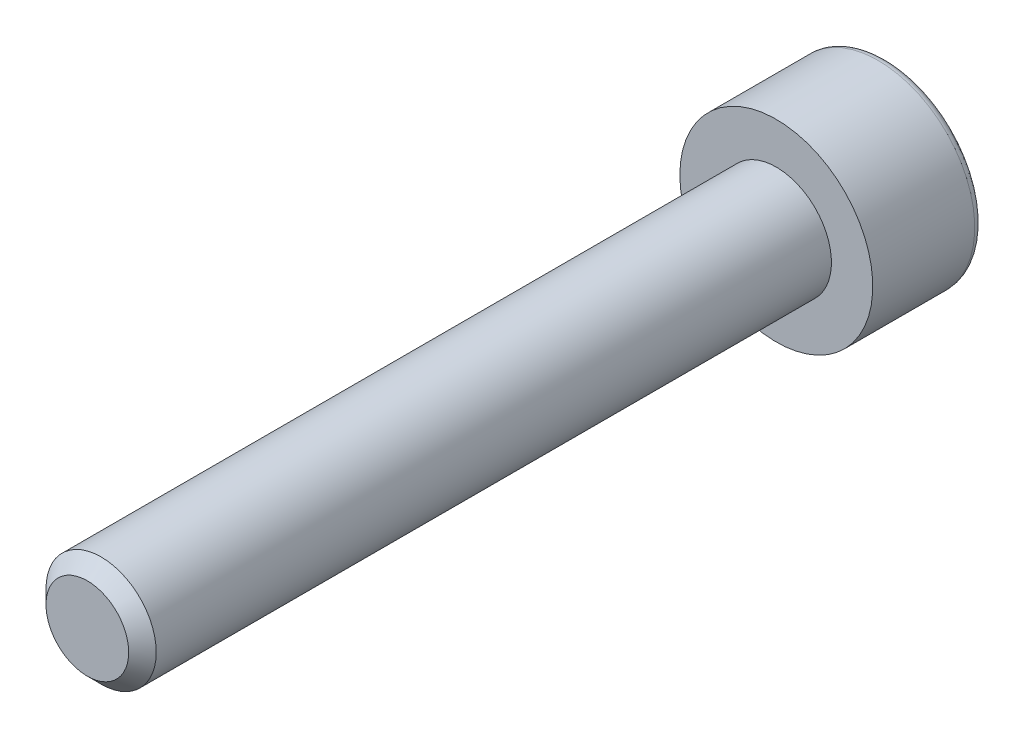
ISO-10303-21;
HEADER;
FILE_DESCRIPTION(('STEP AP214'),'2;1');
FILE_NAME('part.step','',(''),(''),'','','');
FILE_SCHEMA(('AUTOMOTIVE_DESIGN { 1 0 10303 214 1 1 1 1 }'));
ENDSEC;
DATA;
#1=APPLICATION_CONTEXT('core data for automotive mechanical design processes');
#2=APPLICATION_PROTOCOL_DEFINITION('international standard','automotive_design',2000,#1);
#3=PRODUCT_CONTEXT('',#1,'mechanical');
#4=PRODUCT('Part','Part','',(#3));
#5=PRODUCT_RELATED_PRODUCT_CATEGORY('part','',(#4));
#6=PRODUCT_DEFINITION_FORMATION('','',#4);
#7=PRODUCT_DEFINITION_CONTEXT('part definition',#1,'design');
#8=PRODUCT_DEFINITION('design','',#6,#7);
#9=PRODUCT_DEFINITION_SHAPE('','',#8);
#10=(LENGTH_UNIT() NAMED_UNIT(*) SI_UNIT(.MILLI.,.METRE.));
#11=(NAMED_UNIT(*) PLANE_ANGLE_UNIT() SI_UNIT($,.RADIAN.));
#12=(NAMED_UNIT(*) SI_UNIT($,.STERADIAN.) SOLID_ANGLE_UNIT());
#13=UNCERTAINTY_MEASURE_WITH_UNIT(LENGTH_MEASURE(1.E-05),#10,'distance_accuracy_value','');
#14=(GEOMETRIC_REPRESENTATION_CONTEXT(3) GLOBAL_UNCERTAINTY_ASSIGNED_CONTEXT((#13)) GLOBAL_UNIT_ASSIGNED_CONTEXT((#10,
#11,#12)) REPRESENTATION_CONTEXT('',''));
#15=CARTESIAN_POINT('',(0.,0.,0.));
#16=DIRECTION('',(0.,0.,1.));
#17=DIRECTION('',(1.,0.,0.));
#18=AXIS2_PLACEMENT_3D('',#15,#16,#17);
#19=CARTESIAN_POINT('',(0.,0.,25.));
#20=DIRECTION('',(0.,0.,-1.));
#21=DIRECTION('',(-1.,0.,0.));
#22=AXIS2_PLACEMENT_3D('',#19,#20,#21);
#23=CYLINDRICAL_SURFACE('',#22,2.);
#24=CARTESIAN_POINT('',(0.,0.,24.5));
#25=DIRECTION('',(0.,0.,1.));
#26=DIRECTION('',(1.,0.,0.));
#27=AXIS2_PLACEMENT_3D('',#24,#25,#26);
#28=CIRCLE('',#27,2.);
#29=CARTESIAN_POINT('',(2.,0.,24.5));
#30=VERTEX_POINT('',#29);
#31=EDGE_CURVE('E150',#30,#30,#28,.F.);
#32=ORIENTED_EDGE('',*,*,#31,.T.);
#33=EDGE_LOOP('',(#32));
#34=FACE_BOUND('',#33,.T.);
#35=CARTESIAN_POINT('',(0.,0.,0.));
#36=DIRECTION('',(0.,0.,-1.));
#37=DIRECTION('',(-1.,0.,0.));
#38=AXIS2_PLACEMENT_3D('',#35,#36,#37);
#39=CIRCLE('',#38,2.);
#40=CARTESIAN_POINT('',(-2.,0.,0.));
#41=VERTEX_POINT('',#40);
#42=EDGE_CURVE('E144',#41,#41,#39,.T.);
#43=ORIENTED_EDGE('',*,*,#42,.F.);
#44=EDGE_LOOP('',(#43));
#45=FACE_BOUND('',#44,.T.);
#46=ADVANCED_FACE('F34',(#34,#45),#23,.T.);
#47=CARTESIAN_POINT('',(0.,0.,25.));
#48=DIRECTION('',(0.,0.,1.));
#49=DIRECTION('',(1.,0.,0.));
#50=AXIS2_PLACEMENT_3D('',#47,#48,#49);
#51=PLANE('',#50);
#52=CARTESIAN_POINT('',(0.,0.,25.));
#53=DIRECTION('',(0.,0.,1.));
#54=DIRECTION('',(1.,0.,0.));
#55=AXIS2_PLACEMENT_3D('',#52,#53,#54);
#56=CIRCLE('',#55,1.5);
#57=CARTESIAN_POINT('',(1.5,0.,25.));
#58=VERTEX_POINT('',#57);
#59=EDGE_CURVE('E147',#58,#58,#56,.T.);
#60=ORIENTED_EDGE('',*,*,#59,.T.);
#61=EDGE_LOOP('',(#60));
#62=FACE_BOUND('',#61,.T.);
#63=ADVANCED_FACE('F171',(#62),#51,.T.);
#64=CARTESIAN_POINT('',(0.,0.,25.));
#65=DIRECTION('',(0.,0.,-1.));
#66=DIRECTION('',(-1.,0.,0.));
#67=AXIS2_PLACEMENT_3D('',#64,#65,#66);
#68=CONICAL_SURFACE('',#67,1.5,0.785398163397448);
#69=ORIENTED_EDGE('',*,*,#31,.F.);
#70=EDGE_LOOP('',(#69));
#71=FACE_BOUND('',#70,.T.);
#72=ORIENTED_EDGE('',*,*,#59,.F.);
#73=EDGE_LOOP('',(#72));
#74=FACE_BOUND('',#73,.T.);
#75=ADVANCED_FACE('F177',(#71,#74),#68,.T.);
#76=CARTESIAN_POINT('',(0.,0.,0.));
#77=DIRECTION('',(0.,0.,-1.));
#78=DIRECTION('',(-1.,0.,0.));
#79=AXIS2_PLACEMENT_3D('',#76,#77,#78);
#80=PLANE('',#79);
#81=CARTESIAN_POINT('',(0.,0.,0.));
#82=DIRECTION('',(0.,0.,-1.));
#83=DIRECTION('',(-1.,0.,0.));
#84=AXIS2_PLACEMENT_3D('',#81,#82,#83);
#85=CIRCLE('',#84,3.5);
#86=CARTESIAN_POINT('',(-3.5,0.,0.));
#87=VERTEX_POINT('',#86);
#88=EDGE_CURVE('E136',#87,#87,#85,.T.);
#89=ORIENTED_EDGE('',*,*,#88,.F.);
#90=EDGE_LOOP('',(#89));
#91=FACE_BOUND('',#90,.T.);
#92=ORIENTED_EDGE('',*,*,#42,.T.);
#93=EDGE_LOOP('',(#92));
#94=FACE_BOUND('',#93,.T.);
#95=ADVANCED_FACE('F183',(#91,#94),#80,.F.);
#96=CARTESIAN_POINT('',(0.,0.,-4.));
#97=DIRECTION('',(0.,0.,1.));
#98=DIRECTION('',(1.,0.,0.));
#99=AXIS2_PLACEMENT_3D('',#96,#97,#98);
#100=CYLINDRICAL_SURFACE('',#99,3.5);
#101=CARTESIAN_POINT('',(0.,0.,-3.7));
#102=DIRECTION('',(0.,0.,-1.));
#103=DIRECTION('',(-1.,0.,0.));
#104=AXIS2_PLACEMENT_3D('',#101,#102,#103);
#105=CIRCLE('',#104,3.5);
#106=CARTESIAN_POINT('',(-3.5,0.,-3.7));
#107=VERTEX_POINT('',#106);
#108=EDGE_CURVE('E11',#107,#107,#105,.F.);
#109=ORIENTED_EDGE('',*,*,#108,.T.);
#110=EDGE_LOOP('',(#109));
#111=FACE_BOUND('',#110,.T.);
#112=ORIENTED_EDGE('',*,*,#88,.T.);
#113=EDGE_LOOP('',(#112));
#114=FACE_BOUND('',#113,.T.);
#115=ADVANCED_FACE('F166',(#111,#114),#100,.T.);
#116=CARTESIAN_POINT('',(0.,0.,-4.));
#117=DIRECTION('',(0.,0.,-1.));
#118=DIRECTION('',(-1.,0.,0.));
#119=AXIS2_PLACEMENT_3D('',#116,#117,#118);
#120=PLANE('',#119);
#121=DIRECTION('',(0.866025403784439,0.5,0.));
#122=VECTOR('',#121,1.);
#123=CARTESIAN_POINT('',(-1.5,0.86602540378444,-4.));
#124=LINE('',#123,#122);
#125=CARTESIAN_POINT('',(-1.5,0.86602540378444,-4.));
#126=VERTEX_POINT('',#125);
#127=CARTESIAN_POINT('',(0.,1.73205080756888,-4.));
#128=VERTEX_POINT('',#127);
#129=EDGE_CURVE('E49',#126,#128,#124,.T.);
#130=ORIENTED_EDGE('',*,*,#129,.F.);
#131=DIRECTION('',(0.,1.,0.));
#132=VECTOR('',#131,1.);
#133=CARTESIAN_POINT('',(-1.5,-0.86602540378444,-4.));
#134=LINE('',#133,#132);
#135=CARTESIAN_POINT('',(-1.5,-0.86602540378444,-4.));
#136=VERTEX_POINT('',#135);
#137=EDGE_CURVE('E132',#136,#126,#134,.T.);
#138=ORIENTED_EDGE('',*,*,#137,.F.);
#139=DIRECTION('',(-0.866025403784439,0.5,0.));
#140=VECTOR('',#139,1.);
#141=CARTESIAN_POINT('',(0.,-1.73205080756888,-4.));
#142=LINE('',#141,#140);
#143=CARTESIAN_POINT('',(0.,-1.73205080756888,-4.));
#144=VERTEX_POINT('',#143);
#145=EDGE_CURVE('E130',#144,#136,#142,.T.);
#146=ORIENTED_EDGE('',*,*,#145,.F.);
#147=DIRECTION('',(-0.866025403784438,-0.5,0.));
#148=VECTOR('',#147,1.);
#149=CARTESIAN_POINT('',(1.5,-0.866025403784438,-4.));
#150=LINE('',#149,#148);
#151=CARTESIAN_POINT('',(1.5,-0.866025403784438,-4.));
#152=VERTEX_POINT('',#151);
#153=EDGE_CURVE('E97',#152,#144,#150,.T.);
#154=ORIENTED_EDGE('',*,*,#153,.F.);
#155=DIRECTION('',(0.,-1.,0.));
#156=VECTOR('',#155,1.);
#157=CARTESIAN_POINT('',(1.5,0.866025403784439,-4.));
#158=LINE('',#157,#156);
#159=CARTESIAN_POINT('',(1.5,0.866025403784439,-4.));
#160=VERTEX_POINT('',#159);
#161=EDGE_CURVE('E126',#160,#152,#158,.T.);
#162=ORIENTED_EDGE('',*,*,#161,.F.);
#163=DIRECTION('',(0.866025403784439,-0.5,0.));
#164=VECTOR('',#163,1.);
#165=CARTESIAN_POINT('',(0.,1.73205080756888,-4.));
#166=LINE('',#165,#164);
#167=EDGE_CURVE('E123',#128,#160,#166,.T.);
#168=ORIENTED_EDGE('',*,*,#167,.F.);
#169=EDGE_LOOP('',(#130,#138,#146,#154,#162,#168));
#170=FACE_BOUND('',#169,.T.);
#171=CARTESIAN_POINT('',(0.,0.,-4.));
#172=DIRECTION('',(0.,0.,-1.));
#173=DIRECTION('',(-1.,0.,0.));
#174=AXIS2_PLACEMENT_3D('',#171,#172,#173);
#175=CIRCLE('',#174,3.2);
#176=CARTESIAN_POINT('',(-3.2,0.,-4.));
#177=VERTEX_POINT('',#176);
#178=EDGE_CURVE('E42',#177,#177,#175,.T.);
#179=ORIENTED_EDGE('',*,*,#178,.T.);
#180=EDGE_LOOP('',(#179));
#181=FACE_BOUND('',#180,.T.);
#182=ADVANCED_FACE('F155',(#170,#181),#120,.T.);
#183=CARTESIAN_POINT('',(0.,0.,-3.7));
#184=DIRECTION('',(0.,0.,-1.));
#185=DIRECTION('',(-1.,0.,0.));
#186=AXIS2_PLACEMENT_3D('',#183,#184,#185);
#187=TOROIDAL_SURFACE('',#186,3.2,0.3);
#188=ORIENTED_EDGE('',*,*,#108,.F.);
#189=EDGE_LOOP('',(#188));
#190=FACE_BOUND('',#189,.T.);
#191=ORIENTED_EDGE('',*,*,#178,.F.);
#192=EDGE_LOOP('',(#191));
#193=FACE_BOUND('',#192,.T.);
#194=ADVANCED_FACE('F36',(#190,#193),#187,.T.);
#195=CARTESIAN_POINT('',(-1.5,0.86602540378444,0.));
#196=DIRECTION('',(-0.5,0.866025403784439,0.));
#197=DIRECTION('',(-0.866025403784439,-0.5,0.));
#198=AXIS2_PLACEMENT_3D('',#195,#196,#197);
#199=PLANE('',#198);
#200=ORIENTED_EDGE('',*,*,#129,.T.);
#201=DIRECTION('',(0.,0.,-1.));
#202=VECTOR('',#201,1.);
#203=CARTESIAN_POINT('',(0.,1.73205080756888,0.));
#204=LINE('',#203,#202);
#205=CARTESIAN_POINT('',(0.,1.73205080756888,0.));
#206=VERTEX_POINT('',#205);
#207=EDGE_CURVE('E79',#206,#128,#204,.T.);
#208=ORIENTED_EDGE('',*,*,#207,.F.);
#209=DIRECTION('',(0.866025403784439,0.5,0.));
#210=VECTOR('',#209,1.);
#211=CARTESIAN_POINT('',(-1.5,0.86602540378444,0.));
#212=LINE('',#211,#210);
#213=CARTESIAN_POINT('',(-1.5,0.86602540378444,0.));
#214=VERTEX_POINT('',#213);
#215=EDGE_CURVE('E134',#214,#206,#212,.T.);
#216=ORIENTED_EDGE('',*,*,#215,.F.);
#217=DIRECTION('',(0.,0.,-1.));
#218=VECTOR('',#217,1.);
#219=CARTESIAN_POINT('',(-1.5,0.86602540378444,0.));
#220=LINE('',#219,#218);
#221=EDGE_CURVE('E57',#214,#126,#220,.T.);
#222=ORIENTED_EDGE('',*,*,#221,.T.);
#223=EDGE_LOOP('',(#200,#208,#216,#222));
#224=FACE_BOUND('',#223,.T.);
#225=ADVANCED_FACE('F158',(#224),#199,.F.);
#226=CARTESIAN_POINT('',(-1.5,-0.86602540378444,0.));
#227=DIRECTION('',(-1.,0.,0.));
#228=DIRECTION('',(0.,-1.,0.));
#229=AXIS2_PLACEMENT_3D('',#226,#227,#228);
#230=PLANE('',#229);
#231=ORIENTED_EDGE('',*,*,#137,.T.);
#232=ORIENTED_EDGE('',*,*,#221,.F.);
#233=DIRECTION('',(0.,1.,0.));
#234=VECTOR('',#233,1.);
#235=CARTESIAN_POINT('',(-1.5,-0.86602540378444,0.));
#236=LINE('',#235,#234);
#237=CARTESIAN_POINT('',(-1.5,-0.86602540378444,0.));
#238=VERTEX_POINT('',#237);
#239=EDGE_CURVE('E109',#238,#214,#236,.T.);
#240=ORIENTED_EDGE('',*,*,#239,.F.);
#241=DIRECTION('',(0.,0.,-1.));
#242=VECTOR('',#241,1.);
#243=CARTESIAN_POINT('',(-1.5,-0.86602540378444,0.));
#244=LINE('',#243,#242);
#245=EDGE_CURVE('E101',#238,#136,#244,.T.);
#246=ORIENTED_EDGE('',*,*,#245,.T.);
#247=EDGE_LOOP('',(#231,#232,#240,#246));
#248=FACE_BOUND('',#247,.T.);
#249=ADVANCED_FACE('F164',(#248),#230,.F.);
#250=CARTESIAN_POINT('',(0.,-1.73205080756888,0.));
#251=DIRECTION('',(-0.5,-0.866025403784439,0.));
#252=DIRECTION('',(0.866025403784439,-0.5,0.));
#253=AXIS2_PLACEMENT_3D('',#250,#251,#252);
#254=PLANE('',#253);
#255=ORIENTED_EDGE('',*,*,#145,.T.);
#256=ORIENTED_EDGE('',*,*,#245,.F.);
#257=DIRECTION('',(-0.866025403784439,0.5,0.));
#258=VECTOR('',#257,1.);
#259=CARTESIAN_POINT('',(0.,-1.73205080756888,0.));
#260=LINE('',#259,#258);
#261=CARTESIAN_POINT('',(0.,-1.73205080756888,0.));
#262=VERTEX_POINT('',#261);
#263=EDGE_CURVE('E105',#262,#238,#260,.T.);
#264=ORIENTED_EDGE('',*,*,#263,.F.);
#265=DIRECTION('',(0.,0.,-1.));
#266=VECTOR('',#265,1.);
#267=CARTESIAN_POINT('',(0.,-1.73205080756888,0.));
#268=LINE('',#267,#266);
#269=EDGE_CURVE('E90',#262,#144,#268,.T.);
#270=ORIENTED_EDGE('',*,*,#269,.T.);
#271=EDGE_LOOP('',(#255,#256,#264,#270));
#272=FACE_BOUND('',#271,.T.);
#273=ADVANCED_FACE('F106',(#272),#254,.F.);
#274=CARTESIAN_POINT('',(1.5,-0.866025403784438,0.));
#275=DIRECTION('',(0.5,-0.866025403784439,0.));
#276=DIRECTION('',(0.866025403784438,0.5,0.));
#277=AXIS2_PLACEMENT_3D('',#274,#275,#276);
#278=PLANE('',#277);
#279=ORIENTED_EDGE('',*,*,#153,.T.);
#280=ORIENTED_EDGE('',*,*,#269,.F.);
#281=DIRECTION('',(-0.866025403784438,-0.5,0.));
#282=VECTOR('',#281,1.);
#283=CARTESIAN_POINT('',(1.5,-0.866025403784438,0.));
#284=LINE('',#283,#282);
#285=CARTESIAN_POINT('',(1.5,-0.866025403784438,0.));
#286=VERTEX_POINT('',#285);
#287=EDGE_CURVE('E94',#286,#262,#284,.T.);
#288=ORIENTED_EDGE('',*,*,#287,.F.);
#289=DIRECTION('',(0.,0.,-1.));
#290=VECTOR('',#289,1.);
#291=CARTESIAN_POINT('',(1.5,-0.866025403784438,0.));
#292=LINE('',#291,#290);
#293=EDGE_CURVE('E102',#286,#152,#292,.T.);
#294=ORIENTED_EDGE('',*,*,#293,.T.);
#295=EDGE_LOOP('',(#279,#280,#288,#294));
#296=FACE_BOUND('',#295,.T.);
#297=ADVANCED_FACE('F92',(#296),#278,.F.);
#298=CARTESIAN_POINT('',(1.5,0.866025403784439,0.));
#299=DIRECTION('',(1.,0.,0.));
#300=DIRECTION('',(0.,0.,-1.));
#301=AXIS2_PLACEMENT_3D('',#298,#299,#300);
#302=PLANE('',#301);
#303=ORIENTED_EDGE('',*,*,#161,.T.);
#304=ORIENTED_EDGE('',*,*,#293,.F.);
#305=DIRECTION('',(0.,-1.,0.));
#306=VECTOR('',#305,1.);
#307=CARTESIAN_POINT('',(1.5,0.866025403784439,0.));
#308=LINE('',#307,#306);
#309=CARTESIAN_POINT('',(1.5,0.866025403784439,0.));
#310=VERTEX_POINT('',#309);
#311=EDGE_CURVE('E115',#310,#286,#308,.T.);
#312=ORIENTED_EDGE('',*,*,#311,.F.);
#313=DIRECTION('',(0.,0.,-1.));
#314=VECTOR('',#313,1.);
#315=CARTESIAN_POINT('',(1.5,0.866025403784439,0.));
#316=LINE('',#315,#314);
#317=EDGE_CURVE('E139',#310,#160,#316,.T.);
#318=ORIENTED_EDGE('',*,*,#317,.T.);
#319=EDGE_LOOP('',(#303,#304,#312,#318));
#320=FACE_BOUND('',#319,.T.);
#321=ADVANCED_FACE('F203',(#320),#302,.F.);
#322=CARTESIAN_POINT('',(0.,1.73205080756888,0.));
#323=DIRECTION('',(0.5,0.866025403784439,0.));
#324=DIRECTION('',(-0.866025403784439,0.5,0.));
#325=AXIS2_PLACEMENT_3D('',#322,#323,#324);
#326=PLANE('',#325);
#327=ORIENTED_EDGE('',*,*,#167,.T.);
#328=ORIENTED_EDGE('',*,*,#317,.F.);
#329=DIRECTION('',(0.866025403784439,-0.5,0.));
#330=VECTOR('',#329,1.);
#331=CARTESIAN_POINT('',(0.,1.73205080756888,0.));
#332=LINE('',#331,#330);
#333=EDGE_CURVE('E117',#206,#310,#332,.T.);
#334=ORIENTED_EDGE('',*,*,#333,.F.);
#335=ORIENTED_EDGE('',*,*,#207,.T.);
#336=EDGE_LOOP('',(#327,#328,#334,#335));
#337=FACE_BOUND('',#336,.T.);
#338=ADVANCED_FACE('F200',(#337),#326,.F.);
#339=CARTESIAN_POINT('',(1.5,2.59807621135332,0.));
#340=DIRECTION('',(0.,0.,-1.));
#341=DIRECTION('',(-1.,0.,0.));
#342=AXIS2_PLACEMENT_3D('',#339,#340,#341);
#343=PLANE('',#342);
#344=ORIENTED_EDGE('',*,*,#215,.T.);
#345=ORIENTED_EDGE('',*,*,#333,.T.);
#346=ORIENTED_EDGE('',*,*,#311,.T.);
#347=ORIENTED_EDGE('',*,*,#287,.T.);
#348=ORIENTED_EDGE('',*,*,#263,.T.);
#349=ORIENTED_EDGE('',*,*,#239,.T.);
#350=EDGE_LOOP('',(#344,#345,#346,#347,#348,#349));
#351=FACE_BOUND('',#350,.T.);
#352=ADVANCED_FACE('F112',(#351),#343,.T.);
#353=CLOSED_SHELL('',(#46,#63,#75,#95,#115,#182,#194,#225,#249,#273,#297,#321,#338,#352));
#354=MANIFOLD_SOLID_BREP('B2',#353);
#355=ADVANCED_BREP_SHAPE_REPRESENTATION('',(#18,#354),#14);
#356=SHAPE_DEFINITION_REPRESENTATION(#9,#355);
ENDSEC;
END-ISO-10303-21;
